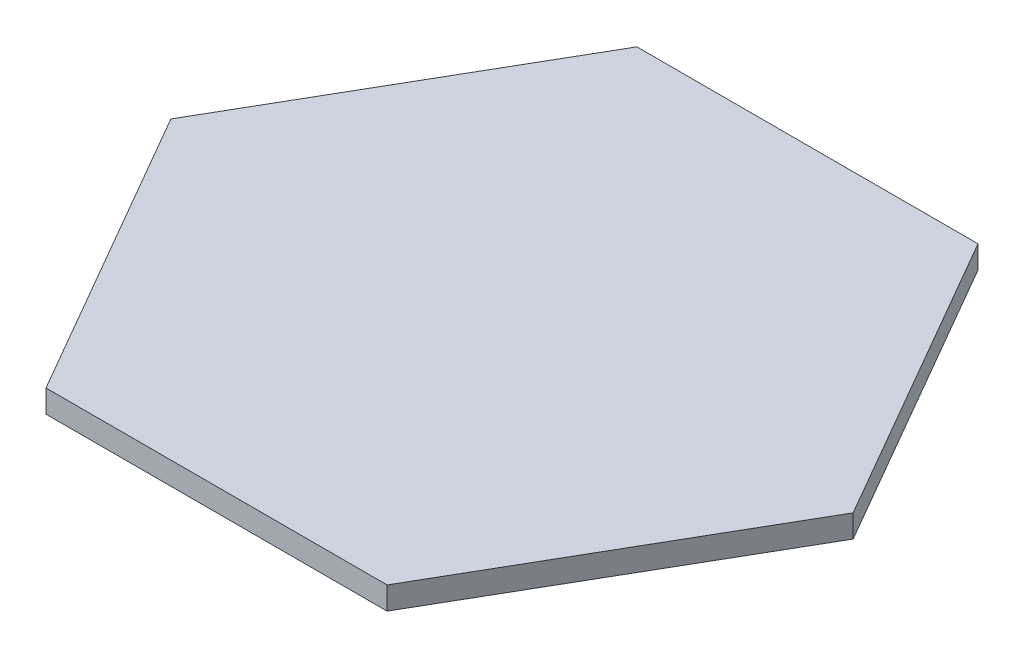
from build123d import *

# Parameters (mm, degrees)
EXTRUDE1_DEPTH = 3.618759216


with BuildPart() as part:
    # Sketch1 → Extrude1 (new body)
    with BuildSketch(Plane(origin=(0, 0, 0), x_dir=(1, 0, 0), z_dir=(0, 1, 0))):
        Polygon((54.363908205, 0), (27.181954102, 47.080525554), (-27.181954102, 47.080525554), (-54.363908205, 0), (-27.181954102, -47.080525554), (27.181954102, -47.080525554), align=None)
    extrude(amount=EXTRUDE1_DEPTH)


solid = part.part
